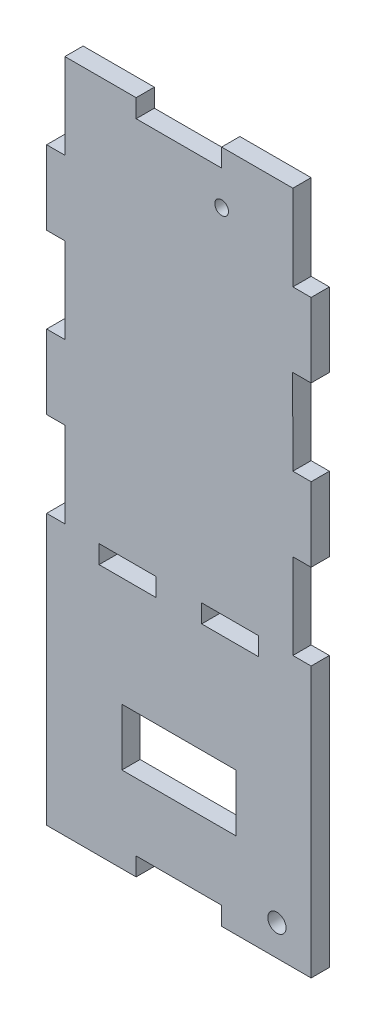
from build123d import *

# Parameters (mm, degrees)
SKETCH1_R           = 6
SKETCH1_R_2         = 8
SKETCH1_W           = 100
SKETCH1_H           = 50
SKETCH1_W_2         = 50
SKETCH1_H_2         = 16
BOSS_EXTRUDE2_DEPTH = 16


with BuildPart() as part:
    # Sketch1 → Boss-Extrude2 (new body)
    with BuildSketch(Plane.XY):
        Polygon((204.000000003, 255), (204, 180), (220, 180), (220, 164), (220, 102.999852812), (220, -36.999852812), (220, -57), (141.499999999, -57), (141.499999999, -41), (66.499999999, -41), (66.499999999, -57), (-12.000000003, -57), (-12.000000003, -36.999852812), (-12.000000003, 102.999852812), (-12.000000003, 164), (-12.000000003, 180), (3.999999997, 180), (3.999999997, 255), (-12, 255.000294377), (-12, 320.000294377), (4, 320.000294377), (4.21013432, 395), (-12, 395), (-12, 460), (4, 460), (4, 535), (66.5, 535), (66.5, 519), (141.5, 519), (141.5, 535), (204, 535), (204, 460), (220, 460), (220, 395), (203.78986568, 395), (204, 320.000294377), (220, 320.000294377), (220, 255.000294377), align=None)
        with Locations((141.5, 489)):
            Circle(SKETCH1_R, mode=Mode.SUBTRACT)
        with Locations((190, -30)):
            Circle(SKETCH1_R_2, mode=Mode.SUBTRACT)
        with Locations((103.999999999, 43)):
            Rectangle(SKETCH1_W, SKETCH1_H, mode=Mode.SUBTRACT)
        with Locations((149, 172)):
            Rectangle(SKETCH1_W_2, SKETCH1_H_2, mode=Mode.SUBTRACT)
        with Locations((58.999999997, 172)):
            Rectangle(SKETCH1_W_2, SKETCH1_H_2, mode=Mode.SUBTRACT)
    extrude(amount=BOSS_EXTRUDE2_DEPTH)


solid = part.part
